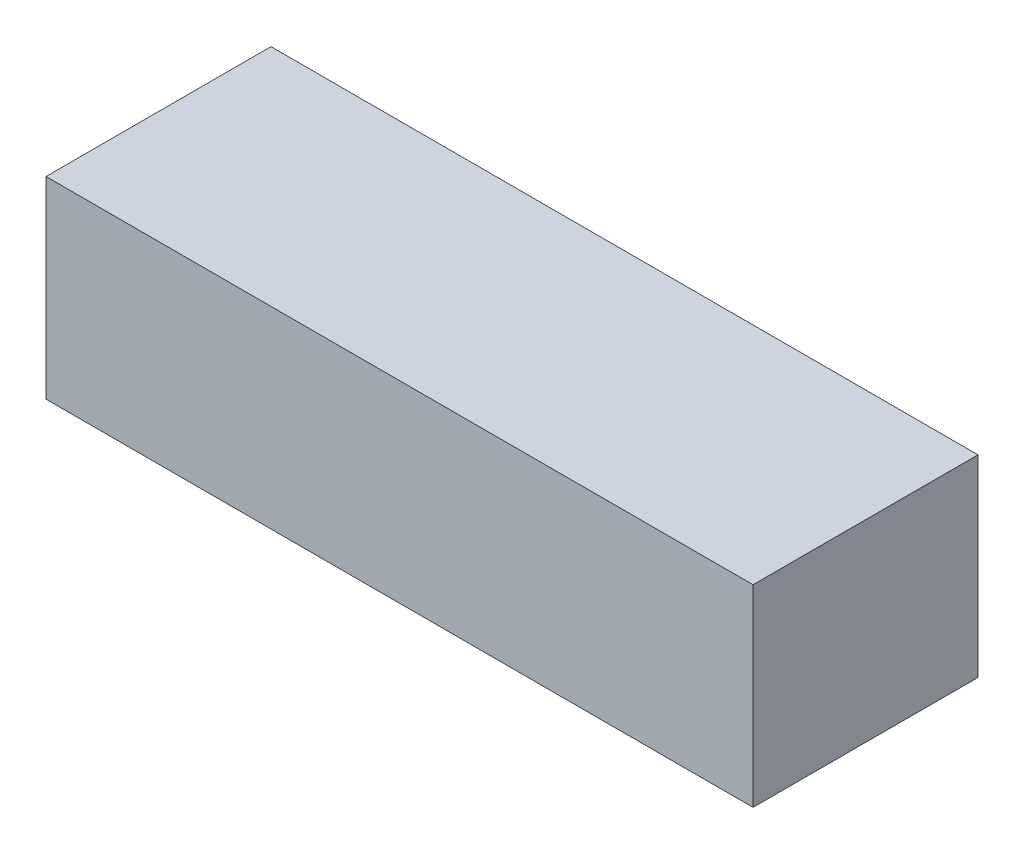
from build123d import *

# Parameters (mm, degrees)
SKETCH1_W           = 139.7
SKETCH1_H           = 44.45
BOSS_EXTRUDE1_DEPTH = 38.1


with BuildPart() as part:
    # Sketch1 → Boss-Extrude1 (new body)
    with BuildSketch(Plane(origin=(0, 0, 0), x_dir=(1, 0, 0), z_dir=(0, 1, 0))):
        Rectangle(SKETCH1_W, SKETCH1_H)
    extrude(amount=BOSS_EXTRUDE1_DEPTH)


solid = part.part
